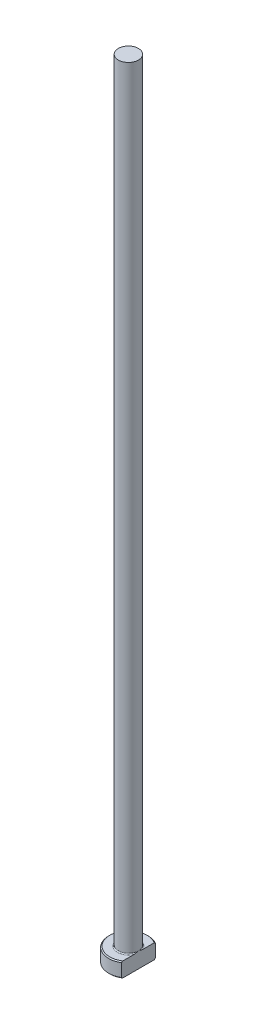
from build123d import *
from build123d.topology import SkipClean

# Parameters (mm, degrees)
CHAMFER1_SIZE = 0.2
FILLET1_R     = 0.2
KEY_DEPTH     = 161.09996877


with BuildPart() as part:
    # Sketch1 → Revolve1 (revolve)
    with BuildSketch(Plane.XY, mode=Mode.PRIVATE) as revolve1_sk:
        Polygon((0, 0), (-4, 0), (-4, 3), (-2.05, 3), (-2.05, 160), (0, 160), align=None)
    revolve(revolve1_sk.sketch.rotate(Axis((0, 259.958771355, 0), (0, -1, 0)), 270), axis=Axis((0, 259.958771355, 0), (0, -1, 0)))

    # Chamfer1
    chamfer1_edges = [part.edges().sort_by_distance(p)[0] for p in [
        (0, 3, -4),
        (0, 0, -4),
    ]]
    chamfer(chamfer1_edges, length=CHAMFER1_SIZE)

    # Fillet1
    fillet1_edges = [part.edges().sort_by_distance(p)[0] for p in [
        (0, 3, -2.05),
    ]]
    fillet(fillet1_edges, radius=FILLET1_R)

    # Sketch2 → KEY (cut, through all)
    with SkipClean():  # the faces are left unmerged after this step: merging them gives an invalid solid
        with BuildSketch(Plane(origin=(0, 0, 0), x_dir=(1, 0, 0), z_dir=(0, 1, 0))):
            with BuildLine():
                Line((2.05, 3.434748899), (2.05, -3.434748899))
                ThreePointArc((2.05, -3.434748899), (4, 0), (2.05, 3.434748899))
            make_face()
        extrude(amount=KEY_DEPTH, mode=Mode.SUBTRACT)


solid = part.part
